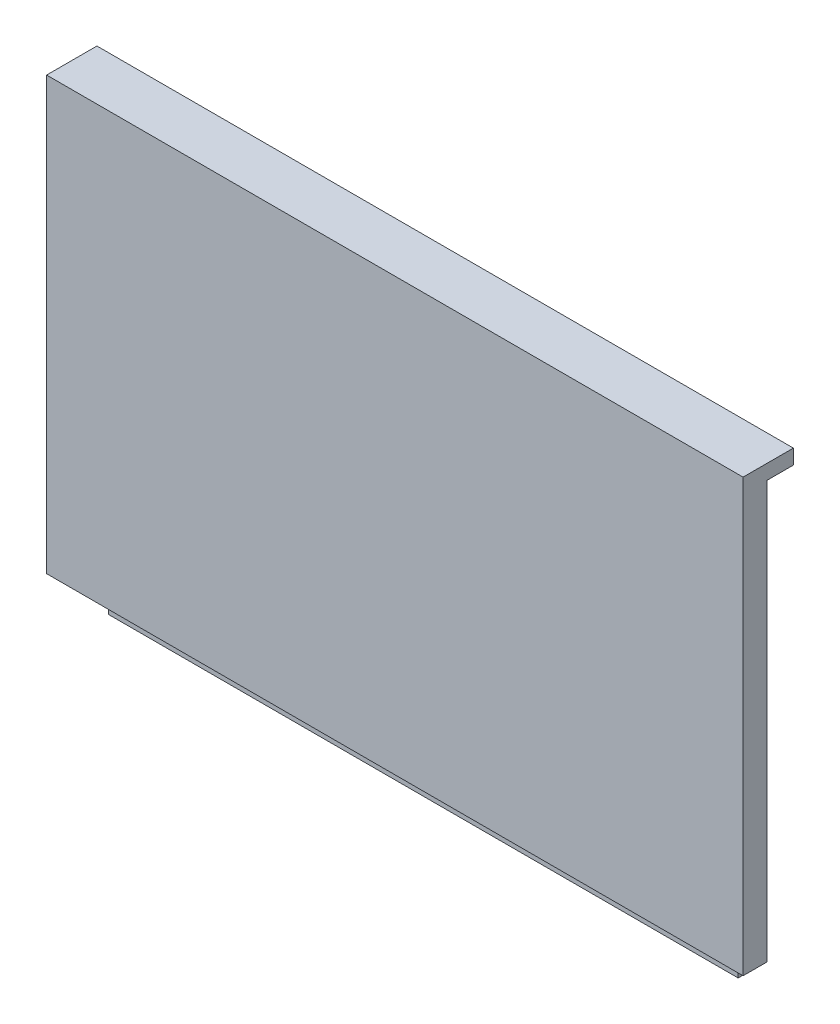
ISO-10303-21;
HEADER;
FILE_DESCRIPTION(('STEP AP214'),'2;1');
FILE_NAME('part.step','',(''),(''),'','','');
FILE_SCHEMA(('AUTOMOTIVE_DESIGN { 1 0 10303 214 1 1 1 1 }'));
ENDSEC;
DATA;
#1=APPLICATION_CONTEXT('core data for automotive mechanical design processes');
#2=APPLICATION_PROTOCOL_DEFINITION('international standard','automotive_design',2000,#1);
#3=PRODUCT_CONTEXT('',#1,'mechanical');
#4=PRODUCT('Part','Part','',(#3));
#5=PRODUCT_RELATED_PRODUCT_CATEGORY('part','',(#4));
#6=PRODUCT_DEFINITION_FORMATION('','',#4);
#7=PRODUCT_DEFINITION_CONTEXT('part definition',#1,'design');
#8=PRODUCT_DEFINITION('design','',#6,#7);
#9=PRODUCT_DEFINITION_SHAPE('','',#8);
#10=(LENGTH_UNIT() NAMED_UNIT(*) SI_UNIT(.MILLI.,.METRE.));
#11=(NAMED_UNIT(*) PLANE_ANGLE_UNIT() SI_UNIT($,.RADIAN.));
#12=(NAMED_UNIT(*) SI_UNIT($,.STERADIAN.) SOLID_ANGLE_UNIT());
#13=UNCERTAINTY_MEASURE_WITH_UNIT(LENGTH_MEASURE(1.E-05),#10,'distance_accuracy_value','');
#14=(GEOMETRIC_REPRESENTATION_CONTEXT(3) GLOBAL_UNCERTAINTY_ASSIGNED_CONTEXT((#13)) GLOBAL_UNIT_ASSIGNED_CONTEXT((#10,
#11,#12)) REPRESENTATION_CONTEXT('',''));
#15=CARTESIAN_POINT('',(0.,0.,0.));
#16=DIRECTION('',(0.,0.,1.));
#17=DIRECTION('',(1.,0.,0.));
#18=AXIS2_PLACEMENT_3D('',#15,#16,#17);
#19=CARTESIAN_POINT('',(28.8,42.5,-1.));
#20=DIRECTION('',(0.,0.,1.));
#21=DIRECTION('',(1.,0.,0.));
#22=AXIS2_PLACEMENT_3D('',#19,#20,#21);
#23=PLANE('',#22);
#24=DIRECTION('',(0.,-1.,0.));
#25=VECTOR('',#24,1.);
#26=CARTESIAN_POINT('',(-28.8,42.5,-0.999999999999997));
#27=LINE('',#26,#25);
#28=CARTESIAN_POINT('',(-28.8,41.15,-1.));
#29=VERTEX_POINT('',#28);
#30=CARTESIAN_POINT('',(-28.8,0.,-0.999999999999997));
#31=VERTEX_POINT('',#30);
#32=EDGE_CURVE('E274',#29,#31,#27,.T.);
#33=ORIENTED_EDGE('',*,*,#32,.F.);
#34=DIRECTION('',(-1.,0.,0.));
#35=VECTOR('',#34,1.);
#36=CARTESIAN_POINT('',(-31.85,41.15,-1.));
#37=LINE('',#36,#35);
#38=CARTESIAN_POINT('',(-31.85,41.15,-1.));
#39=VERTEX_POINT('',#38);
#40=EDGE_CURVE('E188',#29,#39,#37,.T.);
#41=ORIENTED_EDGE('',*,*,#40,.T.);
#42=DIRECTION('',(0.,1.,0.));
#43=VECTOR('',#42,1.);
#44=CARTESIAN_POINT('',(-31.85,41.15,-1.));
#45=LINE('',#44,#43);
#46=CARTESIAN_POINT('',(-31.85,42.5,-1.));
#47=VERTEX_POINT('',#46);
#48=EDGE_CURVE('E194',#39,#47,#45,.T.);
#49=ORIENTED_EDGE('',*,*,#48,.T.);
#50=DIRECTION('',(-1.,0.,0.));
#51=VECTOR('',#50,1.);
#52=CARTESIAN_POINT('',(28.8,42.5,-1.));
#53=LINE('',#52,#51);
#54=CARTESIAN_POINT('',(31.85,42.5,-1.));
#55=VERTEX_POINT('',#54);
#56=EDGE_CURVE('E271',#55,#47,#53,.T.);
#57=ORIENTED_EDGE('',*,*,#56,.F.);
#58=DIRECTION('',(0.,1.,0.));
#59=VECTOR('',#58,1.);
#60=CARTESIAN_POINT('',(31.85,41.15,-1.));
#61=LINE('',#60,#59);
#62=CARTESIAN_POINT('',(31.85,41.15,-1.));
#63=VERTEX_POINT('',#62);
#64=EDGE_CURVE('E193',#63,#55,#61,.T.);
#65=ORIENTED_EDGE('',*,*,#64,.F.);
#66=CARTESIAN_POINT('',(28.8,41.15,-1.));
#67=VERTEX_POINT('',#66);
#68=EDGE_CURVE('E189',#63,#67,#37,.T.);
#69=ORIENTED_EDGE('',*,*,#68,.T.);
#70=DIRECTION('',(0.,-1.,0.));
#71=VECTOR('',#70,1.);
#72=CARTESIAN_POINT('',(28.8,42.5,-1.));
#73=LINE('',#72,#71);
#74=CARTESIAN_POINT('',(28.8,0.,-1.));
#75=VERTEX_POINT('',#74);
#76=EDGE_CURVE('E292',#67,#75,#73,.T.);
#77=ORIENTED_EDGE('',*,*,#76,.T.);
#78=DIRECTION('',(-1.,0.,0.));
#79=VECTOR('',#78,1.);
#80=CARTESIAN_POINT('',(28.8,0.,-1.));
#81=LINE('',#80,#79);
#82=EDGE_CURVE('E275',#75,#31,#81,.T.);
#83=ORIENTED_EDGE('',*,*,#82,.T.);
#84=EDGE_LOOP('',(#33,#41,#49,#57,#65,#69,#77,#83));
#85=FACE_BOUND('',#84,.T.);
#86=DIRECTION('',(-0.5,-0.866025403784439,0.));
#87=VECTOR('',#86,1.);
#88=CARTESIAN_POINT('',(0.,35.4337567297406,-1.));
#89=LINE('',#88,#87);
#90=CARTESIAN_POINT('',(0.,35.4337567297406,-1.));
#91=VERTEX_POINT('',#90);
#92=CARTESIAN_POINT('',(-12.5,13.7831216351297,-1.));
#93=VERTEX_POINT('',#92);
#94=EDGE_CURVE('E62',#91,#93,#89,.T.);
#95=ORIENTED_EDGE('',*,*,#94,.T.);
#96=DIRECTION('',(1.,0.,0.));
#97=VECTOR('',#96,1.);
#98=CARTESIAN_POINT('',(-12.5,13.7831216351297,-1.));
#99=LINE('',#98,#97);
#100=CARTESIAN_POINT('',(12.5,13.7831216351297,-1.));
#101=VERTEX_POINT('',#100);
#102=EDGE_CURVE('E173',#93,#101,#99,.T.);
#103=ORIENTED_EDGE('',*,*,#102,.T.);
#104=DIRECTION('',(-0.5,0.866025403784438,0.));
#105=VECTOR('',#104,1.);
#106=CARTESIAN_POINT('',(12.5,13.7831216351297,-1.));
#107=LINE('',#106,#105);
#108=EDGE_CURVE('E169',#101,#91,#107,.T.);
#109=ORIENTED_EDGE('',*,*,#108,.T.);
#110=EDGE_LOOP('',(#95,#103,#109));
#111=FACE_BOUND('',#110,.T.);
#112=ADVANCED_FACE('F46',(#85,#111),#23,.F.);
#113=CARTESIAN_POINT('',(28.8,42.5,0.999999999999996));
#114=DIRECTION('',(0.,0.,-1.));
#115=DIRECTION('',(-1.,0.,0.));
#116=AXIS2_PLACEMENT_3D('',#113,#114,#115);
#117=PLANE('',#116);
#118=DIRECTION('',(1.,0.,0.));
#119=VECTOR('',#118,1.);
#120=CARTESIAN_POINT('',(-28.8,3.,1.));
#121=LINE('',#120,#119);
#122=CARTESIAN_POINT('',(-28.8,3.,1.));
#123=VERTEX_POINT('',#122);
#124=CARTESIAN_POINT('',(28.8,3.,0.999999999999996));
#125=VERTEX_POINT('',#124);
#126=EDGE_CURVE('E70',#123,#125,#121,.T.);
#127=ORIENTED_EDGE('',*,*,#126,.F.);
#128=DIRECTION('',(0.,-1.,0.));
#129=VECTOR('',#128,1.);
#130=CARTESIAN_POINT('',(-28.8,42.5,1.));
#131=LINE('',#130,#129);
#132=CARTESIAN_POINT('',(-28.8,0.,1.));
#133=VERTEX_POINT('',#132);
#134=EDGE_CURVE('E55',#123,#133,#131,.T.);
#135=ORIENTED_EDGE('',*,*,#134,.T.);
#136=DIRECTION('',(1.,0.,0.));
#137=VECTOR('',#136,1.);
#138=CARTESIAN_POINT('',(28.8,0.,0.999999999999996));
#139=LINE('',#138,#137);
#140=CARTESIAN_POINT('',(28.8,0.,0.999999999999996));
#141=VERTEX_POINT('',#140);
#142=EDGE_CURVE('E279',#133,#141,#139,.T.);
#143=ORIENTED_EDGE('',*,*,#142,.T.);
#144=DIRECTION('',(0.,-1.,0.));
#145=VECTOR('',#144,1.);
#146=CARTESIAN_POINT('',(28.8,42.5,0.999999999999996));
#147=LINE('',#146,#145);
#148=EDGE_CURVE('E295',#125,#141,#147,.T.);
#149=ORIENTED_EDGE('',*,*,#148,.F.);
#150=EDGE_LOOP('',(#127,#135,#143,#149));
#151=FACE_BOUND('',#150,.T.);
#152=ADVANCED_FACE('F299',(#151),#117,.F.);
#153=CARTESIAN_POINT('',(-28.8,42.5,1.));
#154=DIRECTION('',(1.,0.,0.));
#155=DIRECTION('',(0.,0.,-1.));
#156=AXIS2_PLACEMENT_3D('',#153,#154,#155);
#157=PLANE('',#156);
#158=DIRECTION('',(0.,1.,0.));
#159=VECTOR('',#158,1.);
#160=CARTESIAN_POINT('',(-28.8,-63.753039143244,1.4));
#161=LINE('',#160,#159);
#162=CARTESIAN_POINT('',(-28.8,3.,1.4));
#163=VERTEX_POINT('',#162);
#164=CARTESIAN_POINT('',(-28.8,41.15,1.4));
#165=VERTEX_POINT('',#164);
#166=EDGE_CURVE('E247',#163,#165,#161,.T.);
#167=ORIENTED_EDGE('',*,*,#166,.T.);
#168=DIRECTION('',(0.,0.,-1.));
#169=VECTOR('',#168,1.);
#170=CARTESIAN_POINT('',(-28.8,41.15,1.));
#171=LINE('',#170,#169);
#172=EDGE_CURVE('E198',#165,#29,#171,.T.);
#173=ORIENTED_EDGE('',*,*,#172,.T.);
#174=ORIENTED_EDGE('',*,*,#32,.T.);
#175=DIRECTION('',(0.,0.,1.));
#176=VECTOR('',#175,1.);
#177=CARTESIAN_POINT('',(-28.8,0.,1.));
#178=LINE('',#177,#176);
#179=EDGE_CURVE('E270',#31,#133,#178,.T.);
#180=ORIENTED_EDGE('',*,*,#179,.T.);
#181=ORIENTED_EDGE('',*,*,#134,.F.);
#182=DIRECTION('',(0.,0.,-1.));
#183=VECTOR('',#182,1.);
#184=CARTESIAN_POINT('',(-28.8,3.,1.));
#185=LINE('',#184,#183);
#186=EDGE_CURVE('E213',#163,#123,#185,.T.);
#187=ORIENTED_EDGE('',*,*,#186,.F.);
#188=EDGE_LOOP('',(#167,#173,#174,#180,#181,#187));
#189=FACE_BOUND('',#188,.T.);
#190=ADVANCED_FACE('F48',(#189),#157,.F.);
#191=CARTESIAN_POINT('',(28.8,42.5,0.999999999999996));
#192=DIRECTION('',(-1.,0.,0.));
#193=DIRECTION('',(0.,0.,1.));
#194=AXIS2_PLACEMENT_3D('',#191,#192,#193);
#195=PLANE('',#194);
#196=ORIENTED_EDGE('',*,*,#76,.F.);
#197=DIRECTION('',(0.,0.,1.));
#198=VECTOR('',#197,1.);
#199=CARTESIAN_POINT('',(28.8,41.15,0.999999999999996));
#200=LINE('',#199,#198);
#201=CARTESIAN_POINT('',(28.8,41.15,1.4));
#202=VERTEX_POINT('',#201);
#203=EDGE_CURVE('E208',#67,#202,#200,.T.);
#204=ORIENTED_EDGE('',*,*,#203,.T.);
#205=DIRECTION('',(0.,1.,0.));
#206=VECTOR('',#205,1.);
#207=CARTESIAN_POINT('',(28.8,-63.753039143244,1.4));
#208=LINE('',#207,#206);
#209=CARTESIAN_POINT('',(28.8,3.,1.4));
#210=VERTEX_POINT('',#209);
#211=EDGE_CURVE('E218',#210,#202,#208,.T.);
#212=ORIENTED_EDGE('',*,*,#211,.F.);
#213=DIRECTION('',(0.,0.,1.));
#214=VECTOR('',#213,1.);
#215=CARTESIAN_POINT('',(28.8,3.,0.999999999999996));
#216=LINE('',#215,#214);
#217=EDGE_CURVE('E233',#125,#210,#216,.T.);
#218=ORIENTED_EDGE('',*,*,#217,.F.);
#219=ORIENTED_EDGE('',*,*,#148,.T.);
#220=DIRECTION('',(0.,0.,-1.));
#221=VECTOR('',#220,1.);
#222=CARTESIAN_POINT('',(28.8,0.,0.999999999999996));
#223=LINE('',#222,#221);
#224=EDGE_CURVE('E283',#141,#75,#223,.T.);
#225=ORIENTED_EDGE('',*,*,#224,.T.);
#226=EDGE_LOOP('',(#196,#204,#212,#218,#219,#225));
#227=FACE_BOUND('',#226,.T.);
#228=ADVANCED_FACE('F314',(#227),#195,.F.);
#229=CARTESIAN_POINT('',(0.,42.5,0.));
#230=DIRECTION('',(0.,1.,0.));
#231=DIRECTION('',(0.,0.,1.));
#232=AXIS2_PLACEMENT_3D('',#229,#230,#231);
#233=PLANE('',#232);
#234=DIRECTION('',(0.,0.,-1.));
#235=VECTOR('',#234,1.);
#236=CARTESIAN_POINT('',(31.85,42.5,3.6));
#237=LINE('',#236,#235);
#238=CARTESIAN_POINT('',(31.85,42.5,3.6));
#239=VERTEX_POINT('',#238);
#240=EDGE_CURVE('E243',#239,#55,#237,.T.);
#241=ORIENTED_EDGE('',*,*,#240,.T.);
#242=ORIENTED_EDGE('',*,*,#56,.T.);
#243=DIRECTION('',(0.,0.,1.));
#244=VECTOR('',#243,1.);
#245=CARTESIAN_POINT('',(-31.85,42.5,1.4));
#246=LINE('',#245,#244);
#247=CARTESIAN_POINT('',(-31.85,42.5,3.6));
#248=VERTEX_POINT('',#247);
#249=EDGE_CURVE('E212',#47,#248,#246,.T.);
#250=ORIENTED_EDGE('',*,*,#249,.T.);
#251=DIRECTION('',(1.,0.,0.));
#252=VECTOR('',#251,1.);
#253=CARTESIAN_POINT('',(28.931422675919,42.5,3.6));
#254=LINE('',#253,#252);
#255=EDGE_CURVE('E239',#248,#239,#254,.T.);
#256=ORIENTED_EDGE('',*,*,#255,.T.);
#257=EDGE_LOOP('',(#241,#242,#250,#256));
#258=FACE_BOUND('',#257,.T.);
#259=ADVANCED_FACE('F337',(#258),#233,.T.);
#260=CARTESIAN_POINT('',(0.,0.,0.));
#261=DIRECTION('',(0.,1.,0.));
#262=DIRECTION('',(0.,0.,1.));
#263=AXIS2_PLACEMENT_3D('',#260,#261,#262);
#264=PLANE('',#263);
#265=ORIENTED_EDGE('',*,*,#179,.F.);
#266=ORIENTED_EDGE('',*,*,#82,.F.);
#267=ORIENTED_EDGE('',*,*,#224,.F.);
#268=ORIENTED_EDGE('',*,*,#142,.F.);
#269=EDGE_LOOP('',(#265,#266,#267,#268));
#270=FACE_BOUND('',#269,.T.);
#271=ADVANCED_FACE('F305',(#270),#264,.F.);
#272=CARTESIAN_POINT('',(31.85,-63.753039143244,1.4));
#273=DIRECTION('',(0.,0.,-1.));
#274=DIRECTION('',(-1.,0.,0.));
#275=AXIS2_PLACEMENT_3D('',#272,#273,#274);
#276=PLANE('',#275);
#277=DIRECTION('',(-1.,0.,0.));
#278=VECTOR('',#277,1.);
#279=CARTESIAN_POINT('',(31.85,41.15,1.4));
#280=LINE('',#279,#278);
#281=CARTESIAN_POINT('',(31.85,41.15,1.4));
#282=VERTEX_POINT('',#281);
#283=EDGE_CURVE('E205',#282,#202,#280,.T.);
#284=ORIENTED_EDGE('',*,*,#283,.F.);
#285=DIRECTION('',(0.,1.,0.));
#286=VECTOR('',#285,1.);
#287=CARTESIAN_POINT('',(31.85,-63.753039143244,1.4));
#288=LINE('',#287,#286);
#289=CARTESIAN_POINT('',(31.85,3.,1.4));
#290=VERTEX_POINT('',#289);
#291=EDGE_CURVE('E251',#290,#282,#288,.T.);
#292=ORIENTED_EDGE('',*,*,#291,.F.);
#293=DIRECTION('',(1.,0.,0.));
#294=VECTOR('',#293,1.);
#295=CARTESIAN_POINT('',(31.85,3.,1.4));
#296=LINE('',#295,#294);
#297=EDGE_CURVE('E230',#210,#290,#296,.T.);
#298=ORIENTED_EDGE('',*,*,#297,.F.);
#299=ORIENTED_EDGE('',*,*,#211,.T.);
#300=EDGE_LOOP('',(#284,#292,#298,#299));
#301=FACE_BOUND('',#300,.T.);
#302=ADVANCED_FACE('F348',(#301),#276,.T.);
#303=CARTESIAN_POINT('',(31.85,-63.753039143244,3.6));
#304=DIRECTION('',(1.,0.,0.));
#305=DIRECTION('',(0.,0.,-1.));
#306=AXIS2_PLACEMENT_3D('',#303,#304,#305);
#307=PLANE('',#306);
#308=ORIENTED_EDGE('',*,*,#291,.T.);
#309=DIRECTION('',(0.,0.,-1.));
#310=VECTOR('',#309,1.);
#311=CARTESIAN_POINT('',(31.85,41.15,3.6));
#312=LINE('',#311,#310);
#313=EDGE_CURVE('E181',#282,#63,#312,.T.);
#314=ORIENTED_EDGE('',*,*,#313,.T.);
#315=ORIENTED_EDGE('',*,*,#64,.T.);
#316=ORIENTED_EDGE('',*,*,#240,.F.);
#317=DIRECTION('',(0.,1.,0.));
#318=VECTOR('',#317,1.);
#319=CARTESIAN_POINT('',(31.85,-63.753039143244,3.6));
#320=LINE('',#319,#318);
#321=CARTESIAN_POINT('',(31.85,3.,3.6));
#322=VERTEX_POINT('',#321);
#323=EDGE_CURVE('E255',#322,#239,#320,.T.);
#324=ORIENTED_EDGE('',*,*,#323,.F.);
#325=DIRECTION('',(0.,0.,1.));
#326=VECTOR('',#325,1.);
#327=CARTESIAN_POINT('',(31.85,3.,3.6));
#328=LINE('',#327,#326);
#329=EDGE_CURVE('E227',#290,#322,#328,.T.);
#330=ORIENTED_EDGE('',*,*,#329,.F.);
#331=EDGE_LOOP('',(#308,#314,#315,#316,#324,#330));
#332=FACE_BOUND('',#331,.T.);
#333=ADVANCED_FACE('F341',(#332),#307,.T.);
#334=CARTESIAN_POINT('',(28.931422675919,-63.753039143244,3.6));
#335=DIRECTION('',(0.,0.,1.));
#336=DIRECTION('',(1.,0.,0.));
#337=AXIS2_PLACEMENT_3D('',#334,#335,#336);
#338=PLANE('',#337);
#339=ORIENTED_EDGE('',*,*,#323,.T.);
#340=ORIENTED_EDGE('',*,*,#255,.F.);
#341=DIRECTION('',(0.,1.,0.));
#342=VECTOR('',#341,1.);
#343=CARTESIAN_POINT('',(-31.85,-63.753039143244,3.6));
#344=LINE('',#343,#342);
#345=CARTESIAN_POINT('',(-31.85,3.,3.6));
#346=VERTEX_POINT('',#345);
#347=EDGE_CURVE('E258',#346,#248,#344,.T.);
#348=ORIENTED_EDGE('',*,*,#347,.F.);
#349=DIRECTION('',(-1.,0.,0.));
#350=VECTOR('',#349,1.);
#351=CARTESIAN_POINT('',(28.931422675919,3.,3.6));
#352=LINE('',#351,#350);
#353=EDGE_CURVE('E224',#322,#346,#352,.T.);
#354=ORIENTED_EDGE('',*,*,#353,.F.);
#355=EDGE_LOOP('',(#339,#340,#348,#354));
#356=FACE_BOUND('',#355,.T.);
#357=ADVANCED_FACE('F351',(#356),#338,.T.);
#358=CARTESIAN_POINT('',(-31.85,-63.753039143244,1.4));
#359=DIRECTION('',(-1.,0.,0.));
#360=DIRECTION('',(0.,0.,1.));
#361=AXIS2_PLACEMENT_3D('',#358,#359,#360);
#362=PLANE('',#361);
#363=ORIENTED_EDGE('',*,*,#347,.T.);
#364=ORIENTED_EDGE('',*,*,#249,.F.);
#365=ORIENTED_EDGE('',*,*,#48,.F.);
#366=DIRECTION('',(0.,0.,1.));
#367=VECTOR('',#366,1.);
#368=CARTESIAN_POINT('',(-31.85,41.15,3.6));
#369=LINE('',#368,#367);
#370=CARTESIAN_POINT('',(-31.85,41.15,1.4));
#371=VERTEX_POINT('',#370);
#372=EDGE_CURVE('E175',#39,#371,#369,.T.);
#373=ORIENTED_EDGE('',*,*,#372,.T.);
#374=DIRECTION('',(0.,1.,0.));
#375=VECTOR('',#374,1.);
#376=CARTESIAN_POINT('',(-31.85,-63.753039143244,1.4));
#377=LINE('',#376,#375);
#378=CARTESIAN_POINT('',(-31.85,3.,1.4));
#379=VERTEX_POINT('',#378);
#380=EDGE_CURVE('E261',#379,#371,#377,.T.);
#381=ORIENTED_EDGE('',*,*,#380,.F.);
#382=DIRECTION('',(0.,0.,-1.));
#383=VECTOR('',#382,1.);
#384=CARTESIAN_POINT('',(-31.85,3.,1.4));
#385=LINE('',#384,#383);
#386=EDGE_CURVE('E221',#346,#379,#385,.T.);
#387=ORIENTED_EDGE('',*,*,#386,.F.);
#388=EDGE_LOOP('',(#363,#364,#365,#373,#381,#387));
#389=FACE_BOUND('',#388,.T.);
#390=ADVANCED_FACE('F331',(#389),#362,.T.);
#391=CARTESIAN_POINT('',(-28.8,-63.753039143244,1.4));
#392=DIRECTION('',(0.,0.,-1.));
#393=DIRECTION('',(-1.,0.,0.));
#394=AXIS2_PLACEMENT_3D('',#391,#392,#393);
#395=PLANE('',#394);
#396=DIRECTION('',(-1.,0.,0.));
#397=VECTOR('',#396,1.);
#398=CARTESIAN_POINT('',(-28.8,41.15,1.4));
#399=LINE('',#398,#397);
#400=EDGE_CURVE('E12',#165,#371,#399,.T.);
#401=ORIENTED_EDGE('',*,*,#400,.F.);
#402=ORIENTED_EDGE('',*,*,#166,.F.);
#403=DIRECTION('',(1.,0.,0.));
#404=VECTOR('',#403,1.);
#405=CARTESIAN_POINT('',(-28.8,3.,1.4));
#406=LINE('',#405,#404);
#407=EDGE_CURVE('E217',#379,#163,#406,.T.);
#408=ORIENTED_EDGE('',*,*,#407,.F.);
#409=ORIENTED_EDGE('',*,*,#380,.T.);
#410=EDGE_LOOP('',(#401,#402,#408,#409));
#411=FACE_BOUND('',#410,.T.);
#412=ADVANCED_FACE('F324',(#411),#395,.T.);
#413=CARTESIAN_POINT('',(0.,3.,0.));
#414=DIRECTION('',(0.,1.,0.));
#415=DIRECTION('',(0.,0.,1.));
#416=AXIS2_PLACEMENT_3D('',#413,#414,#415);
#417=PLANE('',#416);
#418=ORIENTED_EDGE('',*,*,#217,.T.);
#419=ORIENTED_EDGE('',*,*,#297,.T.);
#420=ORIENTED_EDGE('',*,*,#329,.T.);
#421=ORIENTED_EDGE('',*,*,#353,.T.);
#422=ORIENTED_EDGE('',*,*,#386,.T.);
#423=ORIENTED_EDGE('',*,*,#407,.T.);
#424=ORIENTED_EDGE('',*,*,#186,.T.);
#425=ORIENTED_EDGE('',*,*,#126,.T.);
#426=EDGE_LOOP('',(#418,#419,#420,#421,#422,#423,#424,#425));
#427=FACE_BOUND('',#426,.T.);
#428=ADVANCED_FACE('F318',(#427),#417,.F.);
#429=CARTESIAN_POINT('',(0.,41.15,0.));
#430=DIRECTION('',(0.,-1.,0.));
#431=DIRECTION('',(0.,0.,-1.));
#432=AXIS2_PLACEMENT_3D('',#429,#430,#431);
#433=PLANE('',#432);
#434=ORIENTED_EDGE('',*,*,#172,.F.);
#435=ORIENTED_EDGE('',*,*,#400,.T.);
#436=ORIENTED_EDGE('',*,*,#372,.F.);
#437=ORIENTED_EDGE('',*,*,#40,.F.);
#438=EDGE_LOOP('',(#434,#435,#436,#437));
#439=FACE_BOUND('',#438,.T.);
#440=ADVANCED_FACE('F328',(#439),#433,.T.);
#441=ORIENTED_EDGE('',*,*,#203,.F.);
#442=ORIENTED_EDGE('',*,*,#68,.F.);
#443=ORIENTED_EDGE('',*,*,#313,.F.);
#444=ORIENTED_EDGE('',*,*,#283,.T.);
#445=EDGE_LOOP('',(#441,#442,#443,#444));
#446=FACE_BOUND('',#445,.T.);
#447=ADVANCED_FACE('F346',(#446),#433,.T.);
#448=CARTESIAN_POINT('',(0.,35.4337567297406,0.));
#449=DIRECTION('',(0.866025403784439,-0.5,0.));
#450=DIRECTION('',(0.5,0.866025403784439,0.));
#451=AXIS2_PLACEMENT_3D('',#448,#449,#450);
#452=PLANE('',#451);
#453=ORIENTED_EDGE('',*,*,#94,.F.);
#454=DIRECTION('',(0.,0.,-1.));
#455=VECTOR('',#454,1.);
#456=CARTESIAN_POINT('',(0.,35.4337567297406,0.));
#457=LINE('',#456,#455);
#458=CARTESIAN_POINT('',(0.,35.4337567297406,0.));
#459=VERTEX_POINT('',#458);
#460=EDGE_CURVE('E167',#459,#91,#457,.T.);
#461=ORIENTED_EDGE('',*,*,#460,.F.);
#462=DIRECTION('',(-0.5,-0.866025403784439,0.));
#463=VECTOR('',#462,1.);
#464=CARTESIAN_POINT('',(0.,35.4337567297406,0.));
#465=LINE('',#464,#463);
#466=CARTESIAN_POINT('',(-12.5,13.7831216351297,0.));
#467=VERTEX_POINT('',#466);
#468=EDGE_CURVE('E158',#459,#467,#465,.T.);
#469=ORIENTED_EDGE('',*,*,#468,.T.);
#470=DIRECTION('',(0.,0.,-1.));
#471=VECTOR('',#470,1.);
#472=CARTESIAN_POINT('',(-12.5,13.7831216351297,0.));
#473=LINE('',#472,#471);
#474=EDGE_CURVE('E166',#467,#93,#473,.T.);
#475=ORIENTED_EDGE('',*,*,#474,.T.);
#476=EDGE_LOOP('',(#453,#461,#469,#475));
#477=FACE_BOUND('',#476,.T.);
#478=ADVANCED_FACE('F165',(#477),#452,.T.);
#479=CARTESIAN_POINT('',(-12.5,13.7831216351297,0.));
#480=DIRECTION('',(0.,1.,0.));
#481=DIRECTION('',(0.,0.,1.));
#482=AXIS2_PLACEMENT_3D('',#479,#480,#481);
#483=PLANE('',#482);
#484=ORIENTED_EDGE('',*,*,#102,.F.);
#485=ORIENTED_EDGE('',*,*,#474,.F.);
#486=DIRECTION('',(1.,0.,0.));
#487=VECTOR('',#486,1.);
#488=CARTESIAN_POINT('',(-12.5,13.7831216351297,0.));
#489=LINE('',#488,#487);
#490=CARTESIAN_POINT('',(12.5,13.7831216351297,0.));
#491=VERTEX_POINT('',#490);
#492=EDGE_CURVE('E155',#467,#491,#489,.T.);
#493=ORIENTED_EDGE('',*,*,#492,.T.);
#494=DIRECTION('',(0.,0.,-1.));
#495=VECTOR('',#494,1.);
#496=CARTESIAN_POINT('',(12.5,13.7831216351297,0.));
#497=LINE('',#496,#495);
#498=EDGE_CURVE('E176',#491,#101,#497,.T.);
#499=ORIENTED_EDGE('',*,*,#498,.T.);
#500=EDGE_LOOP('',(#484,#485,#493,#499));
#501=FACE_BOUND('',#500,.T.);
#502=ADVANCED_FACE('F171',(#501),#483,.T.);
#503=CARTESIAN_POINT('',(12.5,13.7831216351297,0.));
#504=DIRECTION('',(-0.866025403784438,-0.5,0.));
#505=DIRECTION('',(0.5,-0.866025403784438,0.));
#506=AXIS2_PLACEMENT_3D('',#503,#504,#505);
#507=PLANE('',#506);
#508=ORIENTED_EDGE('',*,*,#108,.F.);
#509=ORIENTED_EDGE('',*,*,#498,.F.);
#510=DIRECTION('',(-0.5,0.866025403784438,0.));
#511=VECTOR('',#510,1.);
#512=CARTESIAN_POINT('',(12.5,13.7831216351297,0.));
#513=LINE('',#512,#511);
#514=EDGE_CURVE('E159',#491,#459,#513,.T.);
#515=ORIENTED_EDGE('',*,*,#514,.T.);
#516=ORIENTED_EDGE('',*,*,#460,.T.);
#517=EDGE_LOOP('',(#508,#509,#515,#516));
#518=FACE_BOUND('',#517,.T.);
#519=ADVANCED_FACE('F511',(#518),#507,.T.);
#520=CARTESIAN_POINT('',(0.,0.,0.));
#521=DIRECTION('',(0.,0.,1.));
#522=DIRECTION('',(1.,0.,0.));
#523=AXIS2_PLACEMENT_3D('',#520,#521,#522);
#524=PLANE('',#523);
#525=ORIENTED_EDGE('',*,*,#468,.F.);
#526=ORIENTED_EDGE('',*,*,#514,.F.);
#527=ORIENTED_EDGE('',*,*,#492,.F.);
#528=EDGE_LOOP('',(#525,#526,#527));
#529=FACE_BOUND('',#528,.T.);
#530=ADVANCED_FACE('F157',(#529),#524,.F.);
#531=CLOSED_SHELL('',(#112,#152,#190,#228,#259,#271,#302,#333,#357,#390,#412,#428,#440,#447,
#478,#502,#519,#530));
#532=MANIFOLD_SOLID_BREP('B2',#531);
#533=ADVANCED_BREP_SHAPE_REPRESENTATION('',(#18,#532),#14);
#534=SHAPE_DEFINITION_REPRESENTATION(#9,#533);
ENDSEC;
END-ISO-10303-21;
